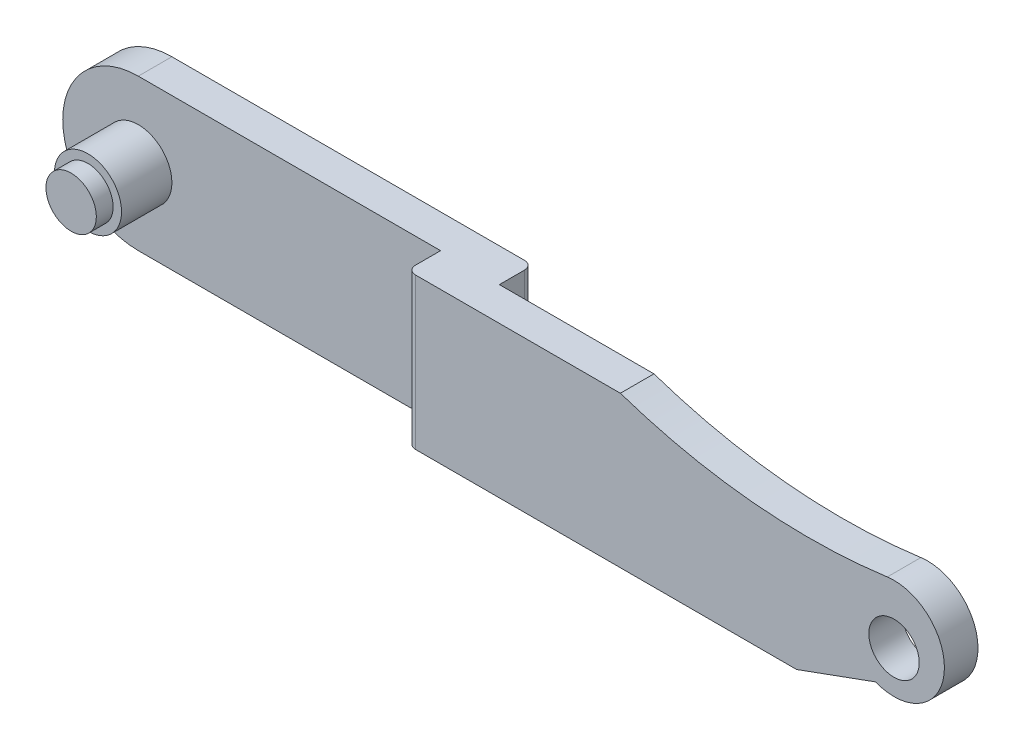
from build123d import *

# Parameters (mm, degrees)
EXTRUSION1_DEPTH        = 2
EXTRUSION2_DEPTH        = 2
ESQUISSE3_R             = 1.5
ENL_V_MAT_EXTRU_1_DEPTH = 51.960769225
ESQUISSE4_R             = 2
EXTRUSION3_DEPTH        = 3
ESQUISSE5_R             = 1.5
EXTRUSION4_DEPTH        = 1
EXTRUSION5_START        = 2
ESQUISSE6_R             = 2
EXTRUSION5_DEPTH        = 2
EXTRUSION6_START        = 1
ESQUISSE7_R             = 1.5
EXTRUSION6_DEPTH        = 1
CONG_1_R                = 0.5


with BuildPart() as part:
    # Esquisse1 → Extrusion1 (new body)
    with BuildSketch(Plane.XY):
        with BuildLine():
            Line((0, 0), (21.5, 0))
            Line((21.5, 0), (21.5, -9))
            Line((21.5, -9), (0, -9))
            ThreePointArc((0, -9), (-4.5, -4.5), (0, 0))
        make_face()
    extrude(amount=EXTRUSION1_DEPTH)

    # Esquisse2 → Extrusion2 (add)
    with BuildSketch(Plane.XY.offset(2)):
        with BuildLine():
            Line((18, 0), (30.70392357, 0))
            ThreePointArc((30.70392357, 0), (38.56279606, -1.682017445), (46.598157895, -1.527034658))
            ThreePointArc((46.598157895, -1.527034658), (49.978086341, -4.861941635), (45.897736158, -7.29016387))
            Line((45.897736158, -7.29016387), (41.2, -9))
            Line((41.2, -9), (18, -9))
            Line((18, -9), (18, 0))
        make_face()
    extrude(amount=EXTRUSION2_DEPTH)

    # Esquisse3 → Enl_v. mat.-Extru.1 (cut, through all)
    with BuildSketch(Plane.XY.offset(4)):
        with Locations((47, -5)):
            Circle(ESQUISSE3_R)
    extrude(amount=-ENL_V_MAT_EXTRU_1_DEPTH, mode=Mode.SUBTRACT)

    # Esquisse4 → Extrusion3 (add)
    with BuildSketch(Plane.XY.offset(2)):
        with Locations((0, -4.5)):
            Circle(ESQUISSE4_R)
    extrude(amount=EXTRUSION3_DEPTH)

    # Esquisse5 → Extrusion4 (add)
    with BuildSketch(Plane.XY.offset(5)):
        with Locations((0, -4.5)):
            Circle(ESQUISSE5_R)
    extrude(amount=EXTRUSION4_DEPTH)

    # Esquisse6 → Extrusion5 (add)
    with BuildSketch(Plane(origin=(0, 0, 0), x_dir=(-1, 0, 0), z_dir=(0, 0, -1)).offset(EXTRUSION5_START)):
        with Locations(Location((0, -4.5, 0), (0, 0, 180))):
            Circle(ESQUISSE6_R)
    extrude(amount=-EXTRUSION5_DEPTH)

    # Esquisse7 → Extrusion6 (add)
    with BuildSketch(Plane(origin=(0, 0, -2), x_dir=(-1, 0, 0), z_dir=(0, 0, -1)).offset(EXTRUSION6_START)):
        with Locations(Location((0, -4.5, 0), (0, 0, 180))):
            Circle(ESQUISSE7_R)
    extrude(amount=-EXTRUSION6_DEPTH)

    # Cong_1
    cong_1_edges = [part.edges().sort_by_distance(p)[0] for p in [
        (21.5, -4.5, 0),
        (18, -4.5, 4),
    ]]
    fillet(cong_1_edges, radius=CONG_1_R)


solid = part.part
